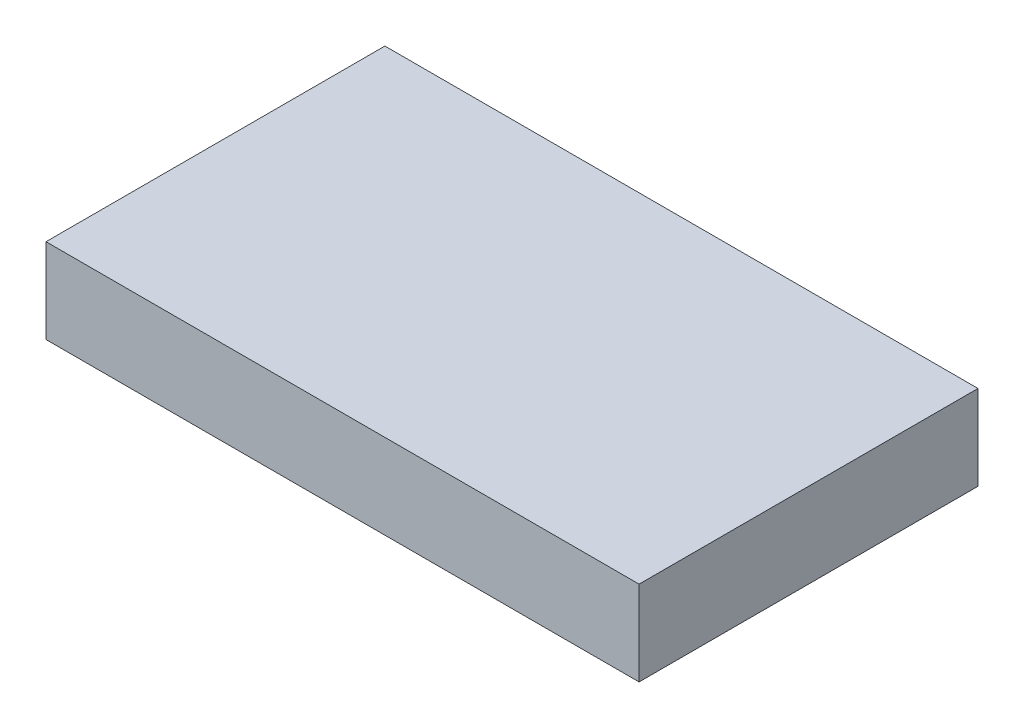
from build123d import *

# Parameters (mm, degrees)
SKETCH_1_W      = 140
SKETCH_1_H      = 80
EXTRUDE_1_DEPTH = 20


with BuildPart() as part:
    # Sketch 1 → Extrude 1 (new body)
    with BuildSketch(Plane(origin=(0, 0, 0), x_dir=(1, 0, 0), z_dir=(0, 1, 0))):
        with Locations((0, -40)):
            Rectangle(SKETCH_1_W, SKETCH_1_H)
    extrude(amount=EXTRUDE_1_DEPTH)


solid = part.part
